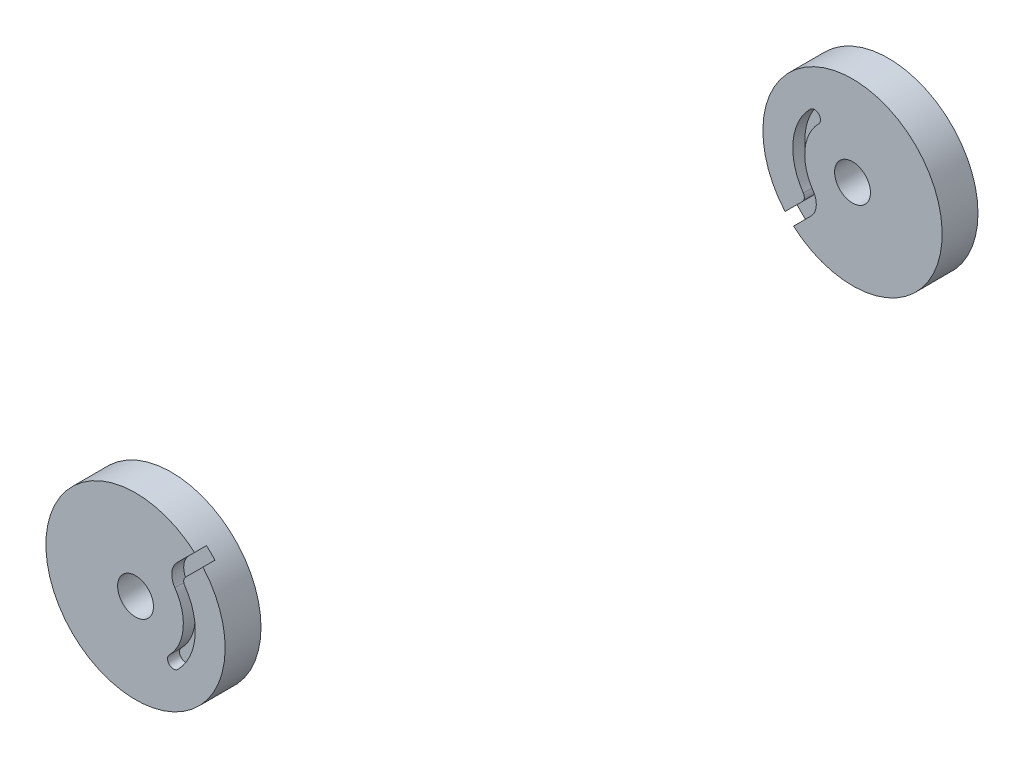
from build123d import *

# Parameters (mm, degrees)
ESQUISSE1_R             = 15
ESQUISSE1_R_2           = 3
EXTRUSION1_DEPTH        = 6
EXTRUSION1_2_DEPTH      = 6
ENL_V_MAT_EXTRU_1_DEPTH = 2


with BuildPart() as part:
    # Esquisse1 → Extrusion1 (new body)
    with BuildSketch(Plane.XY):
        Circle(ESQUISSE1_R)
        Circle(ESQUISSE1_R_2, mode=Mode.SUBTRACT)
    extrude(amount=EXTRUSION1_DEPTH)


with BuildPart() as body_2:
    # Esquisse1 → Extrusion1 2 (new body)
    with BuildSketch(Plane.XY):
        with Locations((120, 120)):
            Circle(ESQUISSE1_R)
        with Locations((120, 120)):
            Circle(ESQUISSE1_R_2, mode=Mode.SUBTRACT)
    extrude(amount=EXTRUSION1_2_DEPTH)


with BuildPart() as enl_v_mat_extru_1_tool:
    # Esquisse2 → Enl_v. mat.-Extru.1 (new body)
    with BuildSketch(Plane.XY.offset(6)):
        with BuildLine():
            Line((6.941422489, 8.355636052), (11.16897695, 12.583190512))
            Line((11.16897695, 12.583190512), (12.583190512, 11.16897695))
            Line((12.583190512, 11.16897695), (8.355636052, 6.941422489))
            ThreePointArc((8.355636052, 6.941422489), (8.066918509, 6.325605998), (8.238857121, 5.667559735))
            ThreePointArc((8.238857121, 5.667559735), (9.958243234, -0.912902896), (7.071067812, -7.071067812))
            ThreePointArc((7.071067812, -7.071067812), (5.656854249, -7.071067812), (5.656854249, -5.656854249))
            ThreePointArc((5.656854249, -5.656854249), (7.966594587, -0.730322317), (6.591085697, 4.534047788))
            ThreePointArc((6.591085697, 4.534047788), (6.075269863, 6.508186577), (6.941422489, 8.355636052))
        make_face()
        with BuildLine():
            Line((108.769799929, 107.355586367), (107.355586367, 108.769799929))
            Line((107.355586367, 108.769799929), (111.644363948, 113.058577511))
            ThreePointArc((111.644363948, 113.058577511), (111.933081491, 113.674394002), (111.761142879, 114.332440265))
            ThreePointArc((111.761142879, 114.332440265), (110.041756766, 120.912902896), (112.928932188, 127.071067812))
            ThreePointArc((112.928932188, 127.071067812), (114.343145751, 127.071067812), (114.343145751, 125.656854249))
            ThreePointArc((114.343145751, 125.656854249), (112.033405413, 120.730322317), (113.408914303, 115.465952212))
            ThreePointArc((113.408914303, 115.465952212), (113.924730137, 113.491813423), (113.058577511, 111.644363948))
            Line((113.058577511, 111.644363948), (108.769799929, 107.355586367))
        make_face()
    extrude(amount=-ENL_V_MAT_EXTRU_1_DEPTH)


with BuildPart() as part_1:
    add(part.part)

    # Enl_v. mat.-Extru.1: cut by enl_v_mat_extru_1_tool
    add(enl_v_mat_extru_1_tool.part, mode=Mode.SUBTRACT)


with BuildPart() as body_2_1:
    add(body_2.part)

    # Enl_v. mat.-Extru.1: cut by enl_v_mat_extru_1_tool
    add(enl_v_mat_extru_1_tool.part, mode=Mode.SUBTRACT)


solid = Compound([part_1.part, body_2_1.part])
